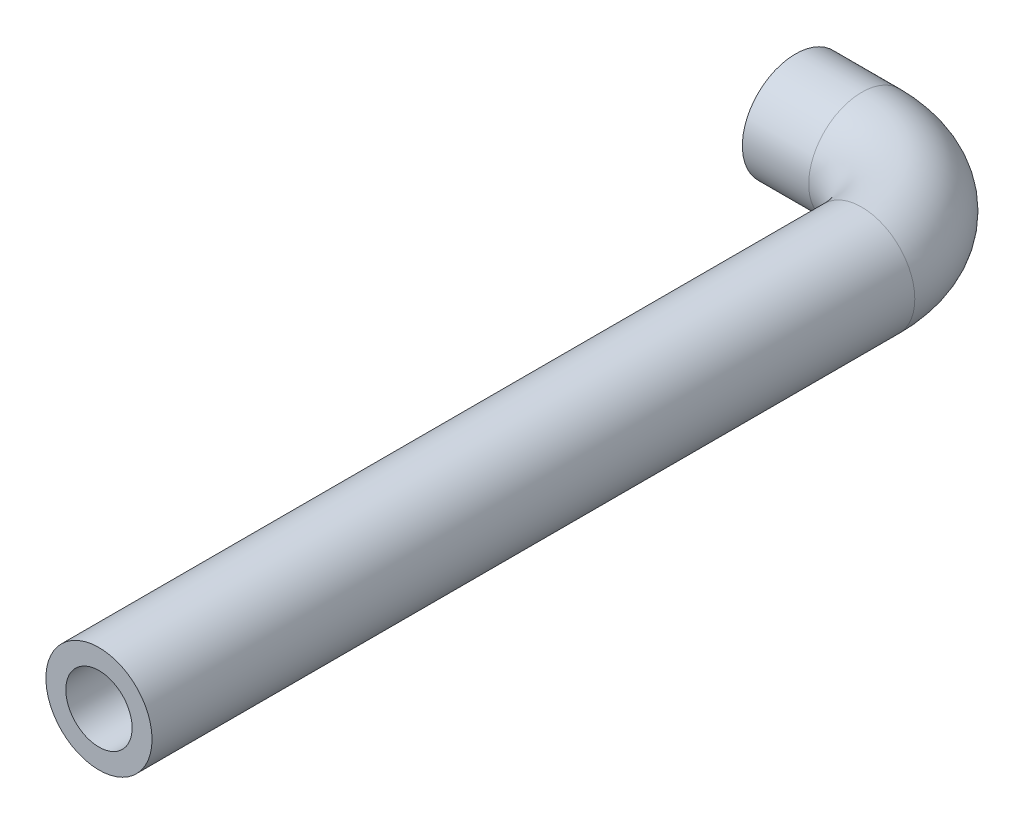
from build123d import *

# Parameters (mm, degrees)
SKETCH_TUBE_SECTION_R   = 8
SKETCH_TUBE_SECTION_R_2 = 5


with BuildPart() as part:
    # Sweep_Toothpaste Tube: sweep along a path in Sketch_Tube Path
    with BuildLine(Plane(origin=(0, 0, 0), x_dir=(1, 0, 0), z_dir=(0, 1, 0))) as sweep_toothpaste_tube_path:
        Line((0, 0), (10, 0))
        ThreePointArc((10, 0), (20.606601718, -4.393398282), (25, -15))
        Line((25, -15), (25, -130))
    # Sketch_Tube Section → Sweep_Toothpaste Tube (sweep)
    with BuildSketch(Plane(origin=(0, 0, 0), x_dir=(0, 0, -1), z_dir=(1, 0, 0))):
        Circle(SKETCH_TUBE_SECTION_R)
        Circle(SKETCH_TUBE_SECTION_R_2, mode=Mode.SUBTRACT)
    sweep(path=sweep_toothpaste_tube_path.line)


solid = part.part
